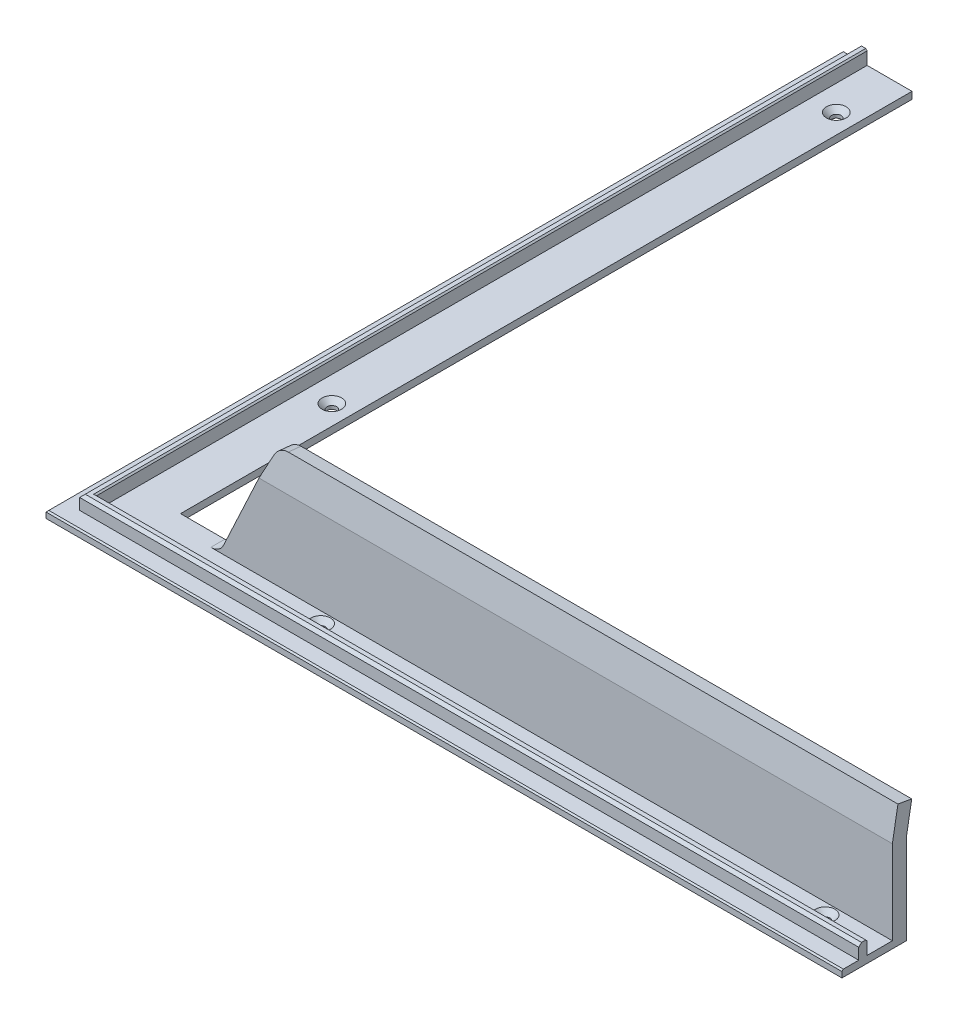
ISO-10303-21;
HEADER;
FILE_DESCRIPTION(('STEP AP214'),'2;1');
FILE_NAME('part.step','',(''),(''),'','','');
FILE_SCHEMA(('AUTOMOTIVE_DESIGN { 1 0 10303 214 1 1 1 1 }'));
ENDSEC;
DATA;
#1=APPLICATION_CONTEXT('core data for automotive mechanical design processes');
#2=APPLICATION_PROTOCOL_DEFINITION('international standard','automotive_design',2000,#1);
#3=PRODUCT_CONTEXT('',#1,'mechanical');
#4=PRODUCT('Part','Part','',(#3));
#5=PRODUCT_RELATED_PRODUCT_CATEGORY('part','',(#4));
#6=PRODUCT_DEFINITION_FORMATION('','',#4);
#7=PRODUCT_DEFINITION_CONTEXT('part definition',#1,'design');
#8=PRODUCT_DEFINITION('design','',#6,#7);
#9=PRODUCT_DEFINITION_SHAPE('','',#8);
#10=(LENGTH_UNIT() NAMED_UNIT(*) SI_UNIT(.MILLI.,.METRE.));
#11=(NAMED_UNIT(*) PLANE_ANGLE_UNIT() SI_UNIT($,.RADIAN.));
#12=(NAMED_UNIT(*) SI_UNIT($,.STERADIAN.) SOLID_ANGLE_UNIT());
#13=UNCERTAINTY_MEASURE_WITH_UNIT(LENGTH_MEASURE(1.E-05),#10,'distance_accuracy_value','');
#14=(GEOMETRIC_REPRESENTATION_CONTEXT(3) GLOBAL_UNCERTAINTY_ASSIGNED_CONTEXT((#13)) GLOBAL_UNIT_ASSIGNED_CONTEXT((#10,
#11,#12)) REPRESENTATION_CONTEXT('',''));
#15=CARTESIAN_POINT('',(0.,0.,0.));
#16=DIRECTION('',(0.,0.,1.));
#17=DIRECTION('',(1.,0.,0.));
#18=AXIS2_PLACEMENT_3D('',#15,#16,#17);
#19=CARTESIAN_POINT('',(0.,3.,0.));
#20=DIRECTION('',(0.,-1.,0.));
#21=DIRECTION('',(0.,0.,-1.));
#22=AXIS2_PLACEMENT_3D('',#19,#20,#21);
#23=PLANE('',#22);
#24=CARTESIAN_POINT('',(239.,3.,8.99999999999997));
#25=DIRECTION('',(0.,1.,0.));
#26=DIRECTION('',(0.,0.,1.));
#27=AXIS2_PLACEMENT_3D('',#24,#25,#26);
#28=CIRCLE('',#27,3.5);
#29=CARTESIAN_POINT('',(239.,3.,12.5));
#30=VERTEX_POINT('',#29);
#31=EDGE_CURVE('E240',#30,#30,#28,.T.);
#32=ORIENTED_EDGE('',*,*,#31,.F.);
#33=EDGE_LOOP('',(#32));
#34=FACE_BOUND('',#33,.T.);
#35=CARTESIAN_POINT('',(59.,3.,8.99999999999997));
#36=DIRECTION('',(0.,1.,0.));
#37=DIRECTION('',(0.,0.,1.));
#38=AXIS2_PLACEMENT_3D('',#35,#36,#37);
#39=CIRCLE('',#38,3.5);
#40=CARTESIAN_POINT('',(59.,3.,12.5));
#41=VERTEX_POINT('',#40);
#42=EDGE_CURVE('E257',#41,#41,#39,.T.);
#43=ORIENTED_EDGE('',*,*,#42,.F.);
#44=EDGE_LOOP('',(#43));
#45=FACE_BOUND('',#44,.T.);
#46=CARTESIAN_POINT('',(-7.00000000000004,3.,-61.0000000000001));
#47=DIRECTION('',(0.,1.,0.));
#48=DIRECTION('',(0.,0.,1.));
#49=AXIS2_PLACEMENT_3D('',#46,#47,#48);
#50=CIRCLE('',#49,3.5);
#51=CARTESIAN_POINT('',(-7.00000000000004,3.,-57.5000000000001));
#52=VERTEX_POINT('',#51);
#53=EDGE_CURVE('E266',#52,#52,#50,.T.);
#54=ORIENTED_EDGE('',*,*,#53,.F.);
#55=EDGE_LOOP('',(#54));
#56=FACE_BOUND('',#55,.T.);
#57=CARTESIAN_POINT('',(-7.00000000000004,3.,-241.));
#58=DIRECTION('',(0.,1.,0.));
#59=DIRECTION('',(0.,0.,1.));
#60=AXIS2_PLACEMENT_3D('',#57,#58,#59);
#61=CIRCLE('',#60,3.5);
#62=CARTESIAN_POINT('',(-7.00000000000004,3.,-237.5));
#63=VERTEX_POINT('',#62);
#64=EDGE_CURVE('E275',#63,#63,#61,.T.);
#65=ORIENTED_EDGE('',*,*,#64,.F.);
#66=EDGE_LOOP('',(#65));
#67=FACE_BOUND('',#66,.T.);
#68=DIRECTION('',(1.,0.,0.));
#69=VECTOR('',#68,1.);
#70=CARTESIAN_POINT('',(19.,3.,5.));
#71=LINE('',#70,#69);
#72=CARTESIAN_POINT('',(15.8146486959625,3.,5.));
#73=VERTEX_POINT('',#72);
#74=CARTESIAN_POINT('',(259.,3.,5.));
#75=VERTEX_POINT('',#74);
#76=EDGE_CURVE('E51',#73,#75,#71,.T.);
#77=ORIENTED_EDGE('',*,*,#76,.F.);
#78=DIRECTION('',(0.,0.,-1.));
#79=VECTOR('',#78,1.);
#80=CARTESIAN_POINT('',(15.8146486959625,3.,0.));
#81=LINE('',#80,#79);
#82=CARTESIAN_POINT('',(15.8146486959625,3.,0.));
#83=VERTEX_POINT('',#82);
#84=EDGE_CURVE('E440',#73,#83,#81,.T.);
#85=ORIENTED_EDGE('',*,*,#84,.T.);
#86=DIRECTION('',(-1.,0.,0.));
#87=VECTOR('',#86,1.);
#88=CARTESIAN_POINT('',(259.,3.,0.));
#89=LINE('',#88,#87);
#90=CARTESIAN_POINT('',(0.,3.,0.));
#91=VERTEX_POINT('',#90);
#92=EDGE_CURVE('E315',#83,#91,#89,.T.);
#93=ORIENTED_EDGE('',*,*,#92,.T.);
#94=DIRECTION('',(0.,0.,-1.));
#95=VECTOR('',#94,1.);
#96=CARTESIAN_POINT('',(0.,3.,0.));
#97=LINE('',#96,#95);
#98=CARTESIAN_POINT('',(0.,3.,-261.));
#99=VERTEX_POINT('',#98);
#100=EDGE_CURVE('E317',#91,#99,#97,.T.);
#101=ORIENTED_EDGE('',*,*,#100,.T.);
#102=DIRECTION('',(-1.,0.,0.));
#103=VECTOR('',#102,1.);
#104=CARTESIAN_POINT('',(0.,3.,-261.));
#105=LINE('',#104,#103);
#106=CARTESIAN_POINT('',(-16.,3.,-261.));
#107=VERTEX_POINT('',#106);
#108=EDGE_CURVE('E320',#99,#107,#105,.T.);
#109=ORIENTED_EDGE('',*,*,#108,.T.);
#110=DIRECTION('',(0.,0.,-1.));
#111=VECTOR('',#110,1.);
#112=CARTESIAN_POINT('',(-16.,3.,14.));
#113=LINE('',#112,#111);
#114=CARTESIAN_POINT('',(-16.,3.,14.));
#115=VERTEX_POINT('',#114);
#116=EDGE_CURVE('E289',#115,#107,#113,.T.);
#117=ORIENTED_EDGE('',*,*,#116,.F.);
#118=DIRECTION('',(-1.,0.,0.));
#119=VECTOR('',#118,1.);
#120=CARTESIAN_POINT('',(259.,3.,14.));
#121=LINE('',#120,#119);
#122=CARTESIAN_POINT('',(259.,3.,14.));
#123=VERTEX_POINT('',#122);
#124=EDGE_CURVE('E299',#123,#115,#121,.T.);
#125=ORIENTED_EDGE('',*,*,#124,.F.);
#126=DIRECTION('',(0.,0.,-1.));
#127=VECTOR('',#126,1.);
#128=CARTESIAN_POINT('',(259.,3.,23.));
#129=LINE('',#128,#127);
#130=EDGE_CURVE('E323',#123,#75,#129,.T.);
#131=ORIENTED_EDGE('',*,*,#130,.T.);
#132=EDGE_LOOP('',(#77,#85,#93,#101,#109,#117,#125,#131));
#133=FACE_BOUND('',#132,.T.);
#134=ADVANCED_FACE('F36',(#34,#45,#56,#67,#133),#23,.F.);
#135=CARTESIAN_POINT('',(-19.,3.,-261.));
#136=VERTEX_POINT('',#135);
#137=CARTESIAN_POINT('',(-24.5,3.,-261.));
#138=VERTEX_POINT('',#137);
#139=EDGE_CURVE('E319',#136,#138,#105,.T.);
#140=ORIENTED_EDGE('',*,*,#139,.T.);
#141=DIRECTION('',(0.,0.,1.));
#142=VECTOR('',#141,1.);
#143=CARTESIAN_POINT('',(-24.5,3.,0.));
#144=LINE('',#143,#142);
#145=CARTESIAN_POINT('',(-24.5,3.,22.5));
#146=VERTEX_POINT('',#145);
#147=EDGE_CURVE('E386',#138,#146,#144,.T.);
#148=ORIENTED_EDGE('',*,*,#147,.T.);
#149=DIRECTION('',(1.,0.,0.));
#150=VECTOR('',#149,1.);
#151=CARTESIAN_POINT('',(0.,3.,22.5));
#152=LINE('',#151,#150);
#153=CARTESIAN_POINT('',(259.,3.,22.5));
#154=VERTEX_POINT('',#153);
#155=EDGE_CURVE('E384',#146,#154,#152,.T.);
#156=ORIENTED_EDGE('',*,*,#155,.T.);
#157=CARTESIAN_POINT('',(259.,3.,17.));
#158=VERTEX_POINT('',#157);
#159=EDGE_CURVE('E324',#154,#158,#129,.T.);
#160=ORIENTED_EDGE('',*,*,#159,.T.);
#161=DIRECTION('',(1.,0.,0.));
#162=VECTOR('',#161,1.);
#163=CARTESIAN_POINT('',(-19.,3.,17.));
#164=LINE('',#163,#162);
#165=CARTESIAN_POINT('',(-19.,3.,17.));
#166=VERTEX_POINT('',#165);
#167=EDGE_CURVE('E295',#166,#158,#164,.T.);
#168=ORIENTED_EDGE('',*,*,#167,.F.);
#169=DIRECTION('',(0.,0.,1.));
#170=VECTOR('',#169,1.);
#171=CARTESIAN_POINT('',(-19.,3.,-261.));
#172=LINE('',#171,#170);
#173=EDGE_CURVE('E292',#136,#166,#172,.T.);
#174=ORIENTED_EDGE('',*,*,#173,.F.);
#175=EDGE_LOOP('',(#140,#148,#156,#160,#168,#174));
#176=FACE_BOUND('',#175,.T.);
#177=ADVANCED_FACE('F482',(#176),#23,.F.);
#178=CARTESIAN_POINT('',(259.,3.,0.));
#179=DIRECTION('',(0.,0.,1.));
#180=DIRECTION('',(1.,0.,0.));
#181=AXIS2_PLACEMENT_3D('',#178,#179,#180);
#182=PLANE('',#181);
#183=ORIENTED_EDGE('',*,*,#92,.F.);
#184=CARTESIAN_POINT('',(15.8146486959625,8.,0.));
#185=DIRECTION('',(0.,0.,1.));
#186=DIRECTION('',(1.,0.,0.));
#187=AXIS2_PLACEMENT_3D('',#184,#185,#186);
#188=CIRCLE('',#187,5.);
#189=CARTESIAN_POINT('',(20.3461876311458,5.88690869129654,0.));
#190=VERTEX_POINT('',#189);
#191=EDGE_CURVE('E44',#83,#190,#188,.T.);
#192=ORIENTED_EDGE('',*,*,#191,.T.);
#193=DIRECTION('',(0.422618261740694,0.906307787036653,0.));
#194=VECTOR('',#193,1.);
#195=CARTESIAN_POINT('',(61.8654868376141,94.9253331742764,0.));
#196=LINE('',#195,#194);
#197=CARTESIAN_POINT('',(32.7852465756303,32.5625566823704,0.));
#198=VERTEX_POINT('',#197);
#199=EDGE_CURVE('E232',#190,#198,#196,.T.);
#200=ORIENTED_EDGE('',*,*,#199,.T.);
#201=DIRECTION('',(1.,0.,0.));
#202=VECTOR('',#201,1.);
#203=CARTESIAN_POINT('',(19.,32.5625566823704,0.));
#204=LINE('',#203,#202);
#205=CARTESIAN_POINT('',(259.,32.5625566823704,0.));
#206=VERTEX_POINT('',#205);
#207=EDGE_CURVE('E247',#198,#206,#204,.T.);
#208=ORIENTED_EDGE('',*,*,#207,.T.);
#209=DIRECTION('',(0.,-1.,0.));
#210=VECTOR('',#209,1.);
#211=CARTESIAN_POINT('',(259.,3.,0.));
#212=LINE('',#211,#210);
#213=CARTESIAN_POINT('',(259.,0.500000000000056,0.));
#214=VERTEX_POINT('',#213);
#215=EDGE_CURVE('E327',#206,#214,#212,.T.);
#216=ORIENTED_EDGE('',*,*,#215,.T.);
#217=DIRECTION('',(-1.,0.,0.));
#218=VECTOR('',#217,1.);
#219=CARTESIAN_POINT('',(0.,0.500000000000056,0.));
#220=LINE('',#219,#218);
#221=CARTESIAN_POINT('',(0.,0.500000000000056,0.));
#222=VERTEX_POINT('',#221);
#223=EDGE_CURVE('E382',#214,#222,#220,.T.);
#224=ORIENTED_EDGE('',*,*,#223,.T.);
#225=DIRECTION('',(0.,-1.,0.));
#226=VECTOR('',#225,1.);
#227=CARTESIAN_POINT('',(0.,3.,0.));
#228=LINE('',#227,#226);
#229=EDGE_CURVE('E342',#91,#222,#228,.T.);
#230=ORIENTED_EDGE('',*,*,#229,.F.);
#231=EDGE_LOOP('',(#183,#192,#200,#208,#216,#224,#230));
#232=FACE_BOUND('',#231,.T.);
#233=ADVANCED_FACE('F443',(#232),#182,.F.);
#234=CARTESIAN_POINT('',(0.,3.,0.));
#235=DIRECTION('',(-1.,0.,0.));
#236=DIRECTION('',(0.,0.,1.));
#237=AXIS2_PLACEMENT_3D('',#234,#235,#236);
#238=PLANE('',#237);
#239=ORIENTED_EDGE('',*,*,#229,.T.);
#240=DIRECTION('',(0.,0.,-1.));
#241=VECTOR('',#240,1.);
#242=CARTESIAN_POINT('',(0.,0.500000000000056,-261.));
#243=LINE('',#242,#241);
#244=CARTESIAN_POINT('',(0.,0.500000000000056,-261.));
#245=VERTEX_POINT('',#244);
#246=EDGE_CURVE('E345',#222,#245,#243,.T.);
#247=ORIENTED_EDGE('',*,*,#246,.T.);
#248=DIRECTION('',(0.,-1.,0.));
#249=VECTOR('',#248,1.);
#250=CARTESIAN_POINT('',(0.,3.,-261.));
#251=LINE('',#250,#249);
#252=EDGE_CURVE('E339',#99,#245,#251,.T.);
#253=ORIENTED_EDGE('',*,*,#252,.F.);
#254=ORIENTED_EDGE('',*,*,#100,.F.);
#255=EDGE_LOOP('',(#239,#247,#253,#254));
#256=FACE_BOUND('',#255,.T.);
#257=ADVANCED_FACE('F512',(#256),#238,.F.);
#258=CARTESIAN_POINT('',(0.,3.,-261.));
#259=DIRECTION('',(0.,0.,1.));
#260=DIRECTION('',(1.,0.,0.));
#261=AXIS2_PLACEMENT_3D('',#258,#259,#260);
#262=PLANE('',#261);
#263=DIRECTION('',(0.,-1.,0.));
#264=VECTOR('',#263,1.);
#265=CARTESIAN_POINT('',(-19.,8.,-261.));
#266=LINE('',#265,#264);
#267=CARTESIAN_POINT('',(-19.,7.,-261.));
#268=VERTEX_POINT('',#267);
#269=EDGE_CURVE('E313',#268,#136,#266,.T.);
#270=ORIENTED_EDGE('',*,*,#269,.F.);
#271=DIRECTION('',(0.707106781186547,0.707106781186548,0.));
#272=VECTOR('',#271,1.);
#273=CARTESIAN_POINT('',(-18.,8.00000000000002,-261.));
#274=LINE('',#273,#272);
#275=CARTESIAN_POINT('',(-18.,8.,-261.));
#276=VERTEX_POINT('',#275);
#277=EDGE_CURVE('E425',#268,#276,#274,.T.);
#278=ORIENTED_EDGE('',*,*,#277,.T.);
#279=DIRECTION('',(-1.,0.,0.));
#280=VECTOR('',#279,1.);
#281=CARTESIAN_POINT('',(-16.,8.,-261.));
#282=LINE('',#281,#280);
#283=CARTESIAN_POINT('',(-16.5000000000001,8.,-261.));
#284=VERTEX_POINT('',#283);
#285=EDGE_CURVE('E285',#284,#276,#282,.T.);
#286=ORIENTED_EDGE('',*,*,#285,.F.);
#287=DIRECTION('',(0.707106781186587,-0.707106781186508,0.));
#288=VECTOR('',#287,1.);
#289=CARTESIAN_POINT('',(-16.5000000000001,8.00000000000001,-261.));
#290=LINE('',#289,#288);
#291=CARTESIAN_POINT('',(-16.,7.49999999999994,-261.));
#292=VERTEX_POINT('',#291);
#293=EDGE_CURVE('E361',#284,#292,#290,.T.);
#294=ORIENTED_EDGE('',*,*,#293,.T.);
#295=DIRECTION('',(0.,-1.,0.));
#296=VECTOR('',#295,1.);
#297=CARTESIAN_POINT('',(-16.,8.,-261.));
#298=LINE('',#297,#296);
#299=EDGE_CURVE('E291',#292,#107,#298,.T.);
#300=ORIENTED_EDGE('',*,*,#299,.T.);
#301=ORIENTED_EDGE('',*,*,#108,.F.);
#302=ORIENTED_EDGE('',*,*,#252,.T.);
#303=DIRECTION('',(-1.,0.,0.));
#304=VECTOR('',#303,1.);
#305=CARTESIAN_POINT('',(-25.,0.500000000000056,-261.));
#306=LINE('',#305,#304);
#307=CARTESIAN_POINT('',(-25.,0.500000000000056,-261.));
#308=VERTEX_POINT('',#307);
#309=EDGE_CURVE('E365',#245,#308,#306,.T.);
#310=ORIENTED_EDGE('',*,*,#309,.T.);
#311=DIRECTION('',(0.,-1.,0.));
#312=VECTOR('',#311,1.);
#313=CARTESIAN_POINT('',(-25.,3.,-261.));
#314=LINE('',#313,#312);
#315=CARTESIAN_POINT('',(-25.,2.5,-261.));
#316=VERTEX_POINT('',#315);
#317=EDGE_CURVE('E336',#316,#308,#314,.T.);
#318=ORIENTED_EDGE('',*,*,#317,.F.);
#319=DIRECTION('',(-0.707106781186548,-0.707106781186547,0.));
#320=VECTOR('',#319,1.);
#321=CARTESIAN_POINT('',(-24.5,2.99999999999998,-261.));
#322=LINE('',#321,#320);
#323=EDGE_CURVE('E363',#316,#138,#322,.F.);
#324=ORIENTED_EDGE('',*,*,#323,.T.);
#325=ORIENTED_EDGE('',*,*,#139,.F.);
#326=EDGE_LOOP('',(#270,#278,#286,#294,#300,#301,#302,#310,#318,#324,#325));
#327=FACE_BOUND('',#326,.T.);
#328=ADVANCED_FACE('F508',(#327),#262,.F.);
#329=CARTESIAN_POINT('',(-25.,3.,-261.));
#330=DIRECTION('',(1.,0.,0.));
#331=DIRECTION('',(0.,0.,-1.));
#332=AXIS2_PLACEMENT_3D('',#329,#330,#331);
#333=PLANE('',#332);
#334=ORIENTED_EDGE('',*,*,#317,.T.);
#335=DIRECTION('',(0.,0.,1.));
#336=VECTOR('',#335,1.);
#337=CARTESIAN_POINT('',(-25.,0.500000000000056,23.));
#338=LINE('',#337,#336);
#339=CARTESIAN_POINT('',(-25.,0.500000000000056,23.));
#340=VERTEX_POINT('',#339);
#341=EDGE_CURVE('E369',#308,#340,#338,.T.);
#342=ORIENTED_EDGE('',*,*,#341,.T.);
#343=DIRECTION('',(0.,-1.,0.));
#344=VECTOR('',#343,1.);
#345=CARTESIAN_POINT('',(-25.,3.,23.));
#346=LINE('',#345,#344);
#347=CARTESIAN_POINT('',(-25.,2.5,23.));
#348=VERTEX_POINT('',#347);
#349=EDGE_CURVE('E333',#348,#340,#346,.T.);
#350=ORIENTED_EDGE('',*,*,#349,.F.);
#351=DIRECTION('',(0.,0.,-1.));
#352=VECTOR('',#351,1.);
#353=CARTESIAN_POINT('',(-25.,2.5,-261.));
#354=LINE('',#353,#352);
#355=EDGE_CURVE('E367',#348,#316,#354,.T.);
#356=ORIENTED_EDGE('',*,*,#355,.T.);
#357=EDGE_LOOP('',(#334,#342,#350,#356));
#358=FACE_BOUND('',#357,.T.);
#359=ADVANCED_FACE('F504',(#358),#333,.F.);
#360=CARTESIAN_POINT('',(-25.,3.,23.));
#361=DIRECTION('',(0.,0.,-1.));
#362=DIRECTION('',(-1.,0.,0.));
#363=AXIS2_PLACEMENT_3D('',#360,#361,#362);
#364=PLANE('',#363);
#365=ORIENTED_EDGE('',*,*,#349,.T.);
#366=DIRECTION('',(1.,0.,0.));
#367=VECTOR('',#366,1.);
#368=CARTESIAN_POINT('',(259.,0.500000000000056,23.));
#369=LINE('',#368,#367);
#370=CARTESIAN_POINT('',(259.,0.500000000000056,23.));
#371=VERTEX_POINT('',#370);
#372=EDGE_CURVE('E373',#340,#371,#369,.T.);
#373=ORIENTED_EDGE('',*,*,#372,.T.);
#374=DIRECTION('',(0.,-1.,0.));
#375=VECTOR('',#374,1.);
#376=CARTESIAN_POINT('',(259.,3.,23.));
#377=LINE('',#376,#375);
#378=CARTESIAN_POINT('',(259.,2.5,23.));
#379=VERTEX_POINT('',#378);
#380=EDGE_CURVE('E330',#379,#371,#377,.T.);
#381=ORIENTED_EDGE('',*,*,#380,.F.);
#382=DIRECTION('',(-1.,0.,0.));
#383=VECTOR('',#382,1.);
#384=CARTESIAN_POINT('',(-25.,2.5,23.));
#385=LINE('',#384,#383);
#386=EDGE_CURVE('E371',#379,#348,#385,.T.);
#387=ORIENTED_EDGE('',*,*,#386,.T.);
#388=EDGE_LOOP('',(#365,#373,#381,#387));
#389=FACE_BOUND('',#388,.T.);
#390=ADVANCED_FACE('F501',(#389),#364,.F.);
#391=CARTESIAN_POINT('',(259.,3.,23.));
#392=DIRECTION('',(-1.,0.,0.));
#393=DIRECTION('',(0.,0.,1.));
#394=AXIS2_PLACEMENT_3D('',#391,#392,#393);
#395=PLANE('',#394);
#396=DIRECTION('',(0.,0.,-1.));
#397=VECTOR('',#396,1.);
#398=CARTESIAN_POINT('',(259.,8.,17.));
#399=LINE('',#398,#397);
#400=CARTESIAN_POINT('',(259.,8.,16.));
#401=VERTEX_POINT('',#400);
#402=CARTESIAN_POINT('',(259.,8.,14.5000000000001));
#403=VERTEX_POINT('',#402);
#404=EDGE_CURVE('E288',#401,#403,#399,.T.);
#405=ORIENTED_EDGE('',*,*,#404,.F.);
#406=DIRECTION('',(0.,-0.707106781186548,0.707106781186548));
#407=VECTOR('',#406,1.);
#408=CARTESIAN_POINT('',(259.,8.,16.));
#409=LINE('',#408,#407);
#410=CARTESIAN_POINT('',(259.,7.,17.));
#411=VERTEX_POINT('',#410);
#412=EDGE_CURVE('E427',#401,#411,#409,.T.);
#413=ORIENTED_EDGE('',*,*,#412,.T.);
#414=DIRECTION('',(0.,-1.,0.));
#415=VECTOR('',#414,1.);
#416=CARTESIAN_POINT('',(259.,8.,17.));
#417=LINE('',#416,#415);
#418=EDGE_CURVE('E309',#411,#158,#417,.T.);
#419=ORIENTED_EDGE('',*,*,#418,.T.);
#420=ORIENTED_EDGE('',*,*,#159,.F.);
#421=DIRECTION('',(0.,0.707106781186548,-0.707106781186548));
#422=VECTOR('',#421,1.);
#423=CARTESIAN_POINT('',(259.,3.,22.5));
#424=LINE('',#423,#422);
#425=EDGE_CURVE('E378',#154,#379,#424,.F.);
#426=ORIENTED_EDGE('',*,*,#425,.T.);
#427=ORIENTED_EDGE('',*,*,#380,.T.);
#428=DIRECTION('',(0.,0.,-1.));
#429=VECTOR('',#428,1.);
#430=CARTESIAN_POINT('',(259.,0.500000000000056,0.));
#431=LINE('',#430,#429);
#432=EDGE_CURVE('E380',#371,#214,#431,.T.);
#433=ORIENTED_EDGE('',*,*,#432,.T.);
#434=ORIENTED_EDGE('',*,*,#215,.F.);
#435=DIRECTION('',(0.,0.984807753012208,-0.173648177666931));
#436=VECTOR('',#435,1.);
#437=CARTESIAN_POINT('',(259.,32.5625566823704,0.));
#438=LINE('',#437,#436);
#439=CARTESIAN_POINT('',(259.,43.3954419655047,-1.91012995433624));
#440=VERTEX_POINT('',#439);
#441=EDGE_CURVE('E448',#206,#440,#438,.T.);
#442=ORIENTED_EDGE('',*,*,#441,.T.);
#443=DIRECTION('',(0.,0.173648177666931,0.984807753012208));
#444=VECTOR('',#443,1.);
#445=CARTESIAN_POINT('',(259.,43.3954419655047,-1.91012995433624));
#446=LINE('',#445,#444);
#447=CARTESIAN_POINT('',(259.,44.2636828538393,3.0139088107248));
#448=VERTEX_POINT('',#447);
#449=EDGE_CURVE('E457',#440,#448,#446,.T.);
#450=ORIENTED_EDGE('',*,*,#449,.T.);
#451=DIRECTION('',(0.,-0.984807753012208,0.173648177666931));
#452=VECTOR('',#451,1.);
#453=CARTESIAN_POINT('',(259.,44.2636828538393,3.0139088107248));
#454=LINE('',#453,#452);
#455=CARTESIAN_POINT('',(259.,33.,5.));
#456=VERTEX_POINT('',#455);
#457=EDGE_CURVE('E456',#448,#456,#454,.T.);
#458=ORIENTED_EDGE('',*,*,#457,.T.);
#459=DIRECTION('',(0.,-1.,0.));
#460=VECTOR('',#459,1.);
#461=CARTESIAN_POINT('',(259.,33.,5.));
#462=LINE('',#461,#460);
#463=EDGE_CURVE('E237',#456,#75,#462,.T.);
#464=ORIENTED_EDGE('',*,*,#463,.T.);
#465=ORIENTED_EDGE('',*,*,#130,.F.);
#466=DIRECTION('',(0.,-1.,0.));
#467=VECTOR('',#466,1.);
#468=CARTESIAN_POINT('',(259.,8.,14.));
#469=LINE('',#468,#467);
#470=CARTESIAN_POINT('',(259.,7.49999999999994,14.));
#471=VERTEX_POINT('',#470);
#472=EDGE_CURVE('E307',#471,#123,#469,.T.);
#473=ORIENTED_EDGE('',*,*,#472,.F.);
#474=DIRECTION('',(0.,0.707106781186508,0.707106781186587));
#475=VECTOR('',#474,1.);
#476=CARTESIAN_POINT('',(259.,8.00000000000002,14.5000000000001));
#477=LINE('',#476,#475);
#478=EDGE_CURVE('E375',#471,#403,#477,.T.);
#479=ORIENTED_EDGE('',*,*,#478,.T.);
#480=EDGE_LOOP('',(#405,#413,#419,#420,#426,#427,#433,#434,#442,#450,#458,#464,#465,#473,#479));
#481=FACE_BOUND('',#480,.T.);
#482=ADVANCED_FACE('F453',(#481),#395,.F.);
#483=CARTESIAN_POINT('',(0.,0.,0.));
#484=DIRECTION('',(0.,-1.,0.));
#485=DIRECTION('',(0.,0.,-1.));
#486=AXIS2_PLACEMENT_3D('',#483,#484,#485);
#487=PLANE('',#486);
#488=CARTESIAN_POINT('',(239.,0.,8.99999999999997));
#489=DIRECTION('',(0.,1.,0.));
#490=DIRECTION('',(0.,0.,1.));
#491=AXIS2_PLACEMENT_3D('',#488,#489,#490);
#492=CIRCLE('',#491,1.70000000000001);
#493=CARTESIAN_POINT('',(239.,0.,10.7));
#494=VERTEX_POINT('',#493);
#495=EDGE_CURVE('E254',#494,#494,#492,.T.);
#496=ORIENTED_EDGE('',*,*,#495,.T.);
#497=EDGE_LOOP('',(#496));
#498=FACE_BOUND('',#497,.T.);
#499=CARTESIAN_POINT('',(59.,0.,8.99999999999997));
#500=DIRECTION('',(0.,1.,0.));
#501=DIRECTION('',(0.,0.,1.));
#502=AXIS2_PLACEMENT_3D('',#499,#500,#501);
#503=CIRCLE('',#502,1.7);
#504=CARTESIAN_POINT('',(59.,0.,10.7));
#505=VERTEX_POINT('',#504);
#506=EDGE_CURVE('E263',#505,#505,#503,.T.);
#507=ORIENTED_EDGE('',*,*,#506,.T.);
#508=EDGE_LOOP('',(#507));
#509=FACE_BOUND('',#508,.T.);
#510=CARTESIAN_POINT('',(-7.00000000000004,0.,-61.0000000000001));
#511=DIRECTION('',(0.,1.,0.));
#512=DIRECTION('',(0.,0.,1.));
#513=AXIS2_PLACEMENT_3D('',#510,#511,#512);
#514=CIRCLE('',#513,1.7);
#515=CARTESIAN_POINT('',(-7.00000000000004,0.,-59.3000000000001));
#516=VERTEX_POINT('',#515);
#517=EDGE_CURVE('E272',#516,#516,#514,.T.);
#518=ORIENTED_EDGE('',*,*,#517,.T.);
#519=EDGE_LOOP('',(#518));
#520=FACE_BOUND('',#519,.T.);
#521=CARTESIAN_POINT('',(-7.00000000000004,0.,-241.));
#522=DIRECTION('',(0.,1.,0.));
#523=DIRECTION('',(0.,0.,1.));
#524=AXIS2_PLACEMENT_3D('',#521,#522,#523);
#525=CIRCLE('',#524,1.7);
#526=CARTESIAN_POINT('',(-7.00000000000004,0.,-239.3));
#527=VERTEX_POINT('',#526);
#528=EDGE_CURVE('E281',#527,#527,#525,.T.);
#529=ORIENTED_EDGE('',*,*,#528,.T.);
#530=EDGE_LOOP('',(#529));
#531=FACE_BOUND('',#530,.T.);
#532=DIRECTION('',(1.,0.,0.));
#533=VECTOR('',#532,1.);
#534=CARTESIAN_POINT('',(0.,0.,-260.5));
#535=LINE('',#534,#533);
#536=CARTESIAN_POINT('',(-24.5,0.,-260.5));
#537=VERTEX_POINT('',#536);
#538=CARTESIAN_POINT('',(-0.5,0.,-260.5));
#539=VERTEX_POINT('',#538);
#540=EDGE_CURVE('E356',#537,#539,#535,.T.);
#541=ORIENTED_EDGE('',*,*,#540,.T.);
#542=DIRECTION('',(0.,0.,1.));
#543=VECTOR('',#542,1.);
#544=CARTESIAN_POINT('',(-0.5,0.,0.));
#545=LINE('',#544,#543);
#546=CARTESIAN_POINT('',(-0.5,0.,0.500000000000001));
#547=VERTEX_POINT('',#546);
#548=EDGE_CURVE('E358',#539,#547,#545,.T.);
#549=ORIENTED_EDGE('',*,*,#548,.T.);
#550=DIRECTION('',(1.,0.,0.));
#551=VECTOR('',#550,1.);
#552=CARTESIAN_POINT('',(259.,0.,0.499999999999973));
#553=LINE('',#552,#551);
#554=CARTESIAN_POINT('',(258.5,0.,0.499999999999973));
#555=VERTEX_POINT('',#554);
#556=EDGE_CURVE('E348',#547,#555,#553,.T.);
#557=ORIENTED_EDGE('',*,*,#556,.T.);
#558=DIRECTION('',(0.,0.,1.));
#559=VECTOR('',#558,1.);
#560=CARTESIAN_POINT('',(258.5,0.,23.));
#561=LINE('',#560,#559);
#562=CARTESIAN_POINT('',(258.5,0.,22.5));
#563=VERTEX_POINT('',#562);
#564=EDGE_CURVE('E350',#555,#563,#561,.T.);
#565=ORIENTED_EDGE('',*,*,#564,.T.);
#566=DIRECTION('',(-1.,0.,0.));
#567=VECTOR('',#566,1.);
#568=CARTESIAN_POINT('',(-25.,0.,22.5));
#569=LINE('',#568,#567);
#570=CARTESIAN_POINT('',(-24.5,0.,22.5));
#571=VERTEX_POINT('',#570);
#572=EDGE_CURVE('E352',#563,#571,#569,.T.);
#573=ORIENTED_EDGE('',*,*,#572,.T.);
#574=DIRECTION('',(0.,0.,-1.));
#575=VECTOR('',#574,1.);
#576=CARTESIAN_POINT('',(-24.5,0.,-261.));
#577=LINE('',#576,#575);
#578=EDGE_CURVE('E354',#571,#537,#577,.T.);
#579=ORIENTED_EDGE('',*,*,#578,.T.);
#580=EDGE_LOOP('',(#541,#549,#557,#565,#573,#579));
#581=FACE_BOUND('',#580,.T.);
#582=ADVANCED_FACE('F495',(#498,#509,#520,#531,#581),#487,.T.);
#583=CARTESIAN_POINT('',(-19.,8.,-261.));
#584=DIRECTION('',(1.,0.,0.));
#585=DIRECTION('',(0.,0.,-1.));
#586=AXIS2_PLACEMENT_3D('',#583,#584,#585);
#587=PLANE('',#586);
#588=DIRECTION('',(0.,-1.,0.));
#589=VECTOR('',#588,1.);
#590=CARTESIAN_POINT('',(-19.,8.,17.));
#591=LINE('',#590,#589);
#592=CARTESIAN_POINT('',(-19.,7.,17.));
#593=VERTEX_POINT('',#592);
#594=EDGE_CURVE('E311',#593,#166,#591,.T.);
#595=ORIENTED_EDGE('',*,*,#594,.F.);
#596=DIRECTION('',(0.,0.,-1.));
#597=VECTOR('',#596,1.);
#598=CARTESIAN_POINT('',(-19.,7.,-261.));
#599=LINE('',#598,#597);
#600=EDGE_CURVE('E423',#593,#268,#599,.T.);
#601=ORIENTED_EDGE('',*,*,#600,.T.);
#602=ORIENTED_EDGE('',*,*,#269,.T.);
#603=ORIENTED_EDGE('',*,*,#173,.T.);
#604=EDGE_LOOP('',(#595,#601,#602,#603));
#605=FACE_BOUND('',#604,.T.);
#606=ADVANCED_FACE('F493',(#605),#587,.F.);
#607=CARTESIAN_POINT('',(-19.,8.,17.));
#608=DIRECTION('',(0.,0.,-1.));
#609=DIRECTION('',(-1.,0.,0.));
#610=AXIS2_PLACEMENT_3D('',#607,#608,#609);
#611=PLANE('',#610);
#612=ORIENTED_EDGE('',*,*,#418,.F.);
#613=DIRECTION('',(-1.,0.,0.));
#614=VECTOR('',#613,1.);
#615=CARTESIAN_POINT('',(-19.,7.,17.));
#616=LINE('',#615,#614);
#617=EDGE_CURVE('E429',#411,#593,#616,.T.);
#618=ORIENTED_EDGE('',*,*,#617,.T.);
#619=ORIENTED_EDGE('',*,*,#594,.T.);
#620=ORIENTED_EDGE('',*,*,#167,.T.);
#621=EDGE_LOOP('',(#612,#618,#619,#620));
#622=FACE_BOUND('',#621,.T.);
#623=ADVANCED_FACE('F612',(#622),#611,.F.);
#624=CARTESIAN_POINT('',(259.,8.,14.));
#625=DIRECTION('',(0.,0.,1.));
#626=DIRECTION('',(1.,0.,0.));
#627=AXIS2_PLACEMENT_3D('',#624,#625,#626);
#628=PLANE('',#627);
#629=DIRECTION('',(0.,-1.,0.));
#630=VECTOR('',#629,1.);
#631=CARTESIAN_POINT('',(-16.,8.,14.));
#632=LINE('',#631,#630);
#633=CARTESIAN_POINT('',(-16.,7.49999999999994,14.));
#634=VERTEX_POINT('',#633);
#635=EDGE_CURVE('E305',#634,#115,#632,.T.);
#636=ORIENTED_EDGE('',*,*,#635,.F.);
#637=DIRECTION('',(1.,0.,0.));
#638=VECTOR('',#637,1.);
#639=CARTESIAN_POINT('',(259.,7.49999999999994,14.));
#640=LINE('',#639,#638);
#641=EDGE_CURVE('E396',#634,#471,#640,.T.);
#642=ORIENTED_EDGE('',*,*,#641,.T.);
#643=ORIENTED_EDGE('',*,*,#472,.T.);
#644=ORIENTED_EDGE('',*,*,#124,.T.);
#645=EDGE_LOOP('',(#636,#642,#643,#644));
#646=FACE_BOUND('',#645,.T.);
#647=ADVANCED_FACE('F638',(#646),#628,.F.);
#648=CARTESIAN_POINT('',(-16.,8.,14.));
#649=DIRECTION('',(-1.,0.,0.));
#650=DIRECTION('',(0.,0.,1.));
#651=AXIS2_PLACEMENT_3D('',#648,#649,#650);
#652=PLANE('',#651);
#653=ORIENTED_EDGE('',*,*,#299,.F.);
#654=DIRECTION('',(0.,0.,1.));
#655=VECTOR('',#654,1.);
#656=CARTESIAN_POINT('',(-16.,7.49999999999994,14.));
#657=LINE('',#656,#655);
#658=EDGE_CURVE('E394',#292,#634,#657,.T.);
#659=ORIENTED_EDGE('',*,*,#658,.T.);
#660=ORIENTED_EDGE('',*,*,#635,.T.);
#661=ORIENTED_EDGE('',*,*,#116,.T.);
#662=EDGE_LOOP('',(#653,#659,#660,#661));
#663=FACE_BOUND('',#662,.T.);
#664=ADVANCED_FACE('F630',(#663),#652,.F.);
#665=CARTESIAN_POINT('',(0.,8.,0.));
#666=DIRECTION('',(0.,1.,0.));
#667=DIRECTION('',(0.,0.,1.));
#668=AXIS2_PLACEMENT_3D('',#665,#666,#667);
#669=PLANE('',#668);
#670=ORIENTED_EDGE('',*,*,#285,.T.);
#671=DIRECTION('',(0.,0.,1.));
#672=VECTOR('',#671,1.);
#673=CARTESIAN_POINT('',(-18.,8.,17.));
#674=LINE('',#673,#672);
#675=CARTESIAN_POINT('',(-18.,8.,16.));
#676=VERTEX_POINT('',#675);
#677=EDGE_CURVE('E420',#276,#676,#674,.T.);
#678=ORIENTED_EDGE('',*,*,#677,.T.);
#679=DIRECTION('',(1.,0.,0.));
#680=VECTOR('',#679,1.);
#681=CARTESIAN_POINT('',(259.,8.,16.));
#682=LINE('',#681,#680);
#683=EDGE_CURVE('E398',#676,#401,#682,.T.);
#684=ORIENTED_EDGE('',*,*,#683,.T.);
#685=ORIENTED_EDGE('',*,*,#404,.T.);
#686=DIRECTION('',(-1.,0.,0.));
#687=VECTOR('',#686,1.);
#688=CARTESIAN_POINT('',(-16.,8.,14.5000000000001));
#689=LINE('',#688,#687);
#690=CARTESIAN_POINT('',(-16.5000000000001,8.,14.5000000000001));
#691=VERTEX_POINT('',#690);
#692=EDGE_CURVE('E389',#403,#691,#689,.T.);
#693=ORIENTED_EDGE('',*,*,#692,.T.);
#694=DIRECTION('',(0.,0.,-1.));
#695=VECTOR('',#694,1.);
#696=CARTESIAN_POINT('',(-16.5000000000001,8.,-261.));
#697=LINE('',#696,#695);
#698=EDGE_CURVE('E391',#691,#284,#697,.T.);
#699=ORIENTED_EDGE('',*,*,#698,.T.);
#700=EDGE_LOOP('',(#670,#678,#684,#685,#693,#699));
#701=FACE_BOUND('',#700,.T.);
#702=ADVANCED_FACE('F562',(#701),#669,.T.);
#703=CARTESIAN_POINT('',(-25.,0.500000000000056,23.));
#704=DIRECTION('',(0.,-0.707106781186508,0.707106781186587));
#705=DIRECTION('',(-1.,0.,0.));
#706=AXIS2_PLACEMENT_3D('',#703,#704,#705);
#707=PLANE('',#706);
#708=DIRECTION('',(0.577350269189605,-0.577350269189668,-0.577350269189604));
#709=VECTOR('',#708,1.);
#710=CARTESIAN_POINT('',(-25.,0.500000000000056,23.));
#711=LINE('',#710,#709);
#712=EDGE_CURVE('E410',#571,#340,#711,.F.);
#713=ORIENTED_EDGE('',*,*,#712,.F.);
#714=ORIENTED_EDGE('',*,*,#572,.F.);
#715=DIRECTION('',(-0.577350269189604,-0.577350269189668,-0.577350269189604));
#716=VECTOR('',#715,1.);
#717=CARTESIAN_POINT('',(259.,0.500000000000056,23.));
#718=LINE('',#717,#716);
#719=EDGE_CURVE('E296',#371,#563,#718,.T.);
#720=ORIENTED_EDGE('',*,*,#719,.F.);
#721=ORIENTED_EDGE('',*,*,#372,.F.);
#722=EDGE_LOOP('',(#713,#714,#720,#721));
#723=FACE_BOUND('',#722,.T.);
#724=ADVANCED_FACE('F556',(#723),#707,.T.);
#725=CARTESIAN_POINT('',(259.,0.500000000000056,23.));
#726=DIRECTION('',(0.707106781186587,-0.707106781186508,0.));
#727=DIRECTION('',(0.,0.,1.));
#728=AXIS2_PLACEMENT_3D('',#725,#726,#727);
#729=PLANE('',#728);
#730=ORIENTED_EDGE('',*,*,#719,.T.);
#731=ORIENTED_EDGE('',*,*,#564,.F.);
#732=DIRECTION('',(-0.577350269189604,-0.577350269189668,0.577350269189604));
#733=VECTOR('',#732,1.);
#734=CARTESIAN_POINT('',(259.,0.500000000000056,0.));
#735=LINE('',#734,#733);
#736=EDGE_CURVE('E407',#214,#555,#735,.T.);
#737=ORIENTED_EDGE('',*,*,#736,.F.);
#738=ORIENTED_EDGE('',*,*,#432,.F.);
#739=EDGE_LOOP('',(#730,#731,#737,#738));
#740=FACE_BOUND('',#739,.T.);
#741=ADVANCED_FACE('F549',(#740),#729,.T.);
#742=CARTESIAN_POINT('',(-25.,0.500000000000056,-261.));
#743=DIRECTION('',(-0.707106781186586,-0.707106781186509,0.));
#744=DIRECTION('',(0.,0.,-1.));
#745=AXIS2_PLACEMENT_3D('',#742,#743,#744);
#746=PLANE('',#745);
#747=ORIENTED_EDGE('',*,*,#712,.T.);
#748=ORIENTED_EDGE('',*,*,#341,.F.);
#749=DIRECTION('',(0.577350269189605,-0.577350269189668,0.577350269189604));
#750=VECTOR('',#749,1.);
#751=CARTESIAN_POINT('',(-25.,0.500000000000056,-261.));
#752=LINE('',#751,#750);
#753=EDGE_CURVE('E404',#537,#308,#752,.F.);
#754=ORIENTED_EDGE('',*,*,#753,.F.);
#755=ORIENTED_EDGE('',*,*,#578,.F.);
#756=EDGE_LOOP('',(#747,#748,#754,#755));
#757=FACE_BOUND('',#756,.T.);
#758=ADVANCED_FACE('F542',(#757),#746,.T.);
#759=CARTESIAN_POINT('',(259.,0.500000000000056,0.));
#760=DIRECTION('',(0.,-0.707106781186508,-0.707106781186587));
#761=DIRECTION('',(1.,0.,0.));
#762=AXIS2_PLACEMENT_3D('',#759,#760,#761);
#763=PLANE('',#762);
#764=ORIENTED_EDGE('',*,*,#736,.T.);
#765=ORIENTED_EDGE('',*,*,#556,.F.);
#766=DIRECTION('',(0.577350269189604,0.577350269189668,-0.577350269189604));
#767=VECTOR('',#766,1.);
#768=CARTESIAN_POINT('',(0.,0.500000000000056,0.));
#769=LINE('',#768,#767);
#770=EDGE_CURVE('E401',#222,#547,#769,.F.);
#771=ORIENTED_EDGE('',*,*,#770,.F.);
#772=ORIENTED_EDGE('',*,*,#223,.F.);
#773=EDGE_LOOP('',(#764,#765,#771,#772));
#774=FACE_BOUND('',#773,.T.);
#775=ADVANCED_FACE('F535',(#774),#763,.T.);
#776=CARTESIAN_POINT('',(0.,0.500000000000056,-261.));
#777=DIRECTION('',(0.,-0.707106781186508,-0.707106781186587));
#778=DIRECTION('',(1.,0.,0.));
#779=AXIS2_PLACEMENT_3D('',#776,#777,#778);
#780=PLANE('',#779);
#781=ORIENTED_EDGE('',*,*,#753,.T.);
#782=ORIENTED_EDGE('',*,*,#309,.F.);
#783=DIRECTION('',(-0.577350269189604,-0.577350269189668,0.577350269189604));
#784=VECTOR('',#783,1.);
#785=CARTESIAN_POINT('',(0.,0.500000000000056,-261.));
#786=LINE('',#785,#784);
#787=EDGE_CURVE('E399',#539,#245,#786,.F.);
#788=ORIENTED_EDGE('',*,*,#787,.F.);
#789=ORIENTED_EDGE('',*,*,#540,.F.);
#790=EDGE_LOOP('',(#781,#782,#788,#789));
#791=FACE_BOUND('',#790,.T.);
#792=ADVANCED_FACE('F528',(#791),#780,.T.);
#793=CARTESIAN_POINT('',(0.,0.500000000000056,0.));
#794=DIRECTION('',(0.707106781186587,-0.707106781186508,0.));
#795=DIRECTION('',(0.,0.,1.));
#796=AXIS2_PLACEMENT_3D('',#793,#794,#795);
#797=PLANE('',#796);
#798=ORIENTED_EDGE('',*,*,#770,.T.);
#799=ORIENTED_EDGE('',*,*,#548,.F.);
#800=ORIENTED_EDGE('',*,*,#787,.T.);
#801=ORIENTED_EDGE('',*,*,#246,.F.);
#802=EDGE_LOOP('',(#798,#799,#800,#801));
#803=FACE_BOUND('',#802,.T.);
#804=ADVANCED_FACE('F520',(#803),#797,.T.);
#805=CARTESIAN_POINT('',(0.,3.,22.5));
#806=DIRECTION('',(0.,-0.707106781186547,-0.707106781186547));
#807=DIRECTION('',(1.,0.,0.));
#808=AXIS2_PLACEMENT_3D('',#805,#806,#807);
#809=PLANE('',#808);
#810=ORIENTED_EDGE('',*,*,#425,.F.);
#811=ORIENTED_EDGE('',*,*,#155,.F.);
#812=DIRECTION('',(-0.577350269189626,-0.577350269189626,0.577350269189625));
#813=VECTOR('',#812,1.);
#814=CARTESIAN_POINT('',(-16.3333333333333,11.1666666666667,14.3333333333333));
#815=LINE('',#814,#813);
#816=EDGE_CURVE('E402',#348,#146,#815,.F.);
#817=ORIENTED_EDGE('',*,*,#816,.F.);
#818=ORIENTED_EDGE('',*,*,#386,.F.);
#819=EDGE_LOOP('',(#810,#811,#817,#818));
#820=FACE_BOUND('',#819,.T.);
#821=ADVANCED_FACE('F527',(#820),#809,.F.);
#822=CARTESIAN_POINT('',(-24.5,3.,0.));
#823=DIRECTION('',(0.707106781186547,-0.707106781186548,0.));
#824=DIRECTION('',(0.,0.,1.));
#825=AXIS2_PLACEMENT_3D('',#822,#823,#824);
#826=PLANE('',#825);
#827=ORIENTED_EDGE('',*,*,#323,.F.);
#828=ORIENTED_EDGE('',*,*,#355,.F.);
#829=ORIENTED_EDGE('',*,*,#816,.T.);
#830=ORIENTED_EDGE('',*,*,#147,.F.);
#831=EDGE_LOOP('',(#827,#828,#829,#830));
#832=FACE_BOUND('',#831,.T.);
#833=ADVANCED_FACE('F565',(#832),#826,.F.);
#834=CARTESIAN_POINT('',(0.,8.,14.5000000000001));
#835=DIRECTION('',(0.,0.707106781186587,-0.707106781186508));
#836=DIRECTION('',(1.,0.,0.));
#837=AXIS2_PLACEMENT_3D('',#834,#835,#836);
#838=PLANE('',#837);
#839=ORIENTED_EDGE('',*,*,#478,.F.);
#840=ORIENTED_EDGE('',*,*,#641,.F.);
#841=DIRECTION('',(-0.577350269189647,0.577350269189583,0.577350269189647));
#842=VECTOR('',#841,1.);
#843=CARTESIAN_POINT('',(-11.6666666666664,3.16666666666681,9.66666666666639));
#844=LINE('',#843,#842);
#845=EDGE_CURVE('E416',#691,#634,#844,.F.);
#846=ORIENTED_EDGE('',*,*,#845,.F.);
#847=ORIENTED_EDGE('',*,*,#692,.F.);
#848=EDGE_LOOP('',(#839,#840,#846,#847));
#849=FACE_BOUND('',#848,.T.);
#850=ADVANCED_FACE('F571',(#849),#838,.T.);
#851=CARTESIAN_POINT('',(-16.5000000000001,8.,0.));
#852=DIRECTION('',(0.707106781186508,0.707106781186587,0.));
#853=DIRECTION('',(0.,0.,1.));
#854=AXIS2_PLACEMENT_3D('',#851,#852,#853);
#855=PLANE('',#854);
#856=ORIENTED_EDGE('',*,*,#845,.T.);
#857=ORIENTED_EDGE('',*,*,#658,.F.);
#858=ORIENTED_EDGE('',*,*,#293,.F.);
#859=ORIENTED_EDGE('',*,*,#698,.F.);
#860=EDGE_LOOP('',(#856,#857,#858,#859));
#861=FACE_BOUND('',#860,.T.);
#862=ADVANCED_FACE('F579',(#861),#855,.T.);
#863=CARTESIAN_POINT('',(0.,8.,16.));
#864=DIRECTION('',(0.,0.707106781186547,0.707106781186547));
#865=DIRECTION('',(-1.,0.,0.));
#866=AXIS2_PLACEMENT_3D('',#863,#864,#865);
#867=PLANE('',#866);
#868=ORIENTED_EDGE('',*,*,#412,.F.);
#869=ORIENTED_EDGE('',*,*,#683,.F.);
#870=DIRECTION('',(-0.577350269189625,-0.577350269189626,0.577350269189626));
#871=VECTOR('',#870,1.);
#872=CARTESIAN_POINT('',(-12.,14.,9.99999999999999));
#873=LINE('',#872,#871);
#874=EDGE_CURVE('E284',#593,#676,#873,.F.);
#875=ORIENTED_EDGE('',*,*,#874,.F.);
#876=ORIENTED_EDGE('',*,*,#617,.F.);
#877=EDGE_LOOP('',(#868,#869,#875,#876));
#878=FACE_BOUND('',#877,.T.);
#879=ADVANCED_FACE('F585',(#878),#867,.T.);
#880=CARTESIAN_POINT('',(-18.,8.,0.));
#881=DIRECTION('',(-0.707106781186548,0.707106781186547,0.));
#882=DIRECTION('',(0.,0.,-1.));
#883=AXIS2_PLACEMENT_3D('',#880,#881,#882);
#884=PLANE('',#883);
#885=ORIENTED_EDGE('',*,*,#277,.F.);
#886=ORIENTED_EDGE('',*,*,#600,.F.);
#887=ORIENTED_EDGE('',*,*,#874,.T.);
#888=ORIENTED_EDGE('',*,*,#677,.F.);
#889=EDGE_LOOP('',(#885,#886,#887,#888));
#890=FACE_BOUND('',#889,.T.);
#891=ADVANCED_FACE('F593',(#890),#884,.T.);
#892=CARTESIAN_POINT('',(-7.00000000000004,3.,-241.));
#893=DIRECTION('',(0.,1.,0.));
#894=DIRECTION('',(0.,0.,1.));
#895=AXIS2_PLACEMENT_3D('',#892,#893,#894);
#896=CYLINDRICAL_SURFACE('',#895,1.7);
#897=ORIENTED_EDGE('',*,*,#528,.F.);
#898=EDGE_LOOP('',(#897));
#899=FACE_BOUND('',#898,.T.);
#900=CARTESIAN_POINT('',(-7.00000000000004,1.2,-241.));
#901=DIRECTION('',(0.,1.,0.));
#902=DIRECTION('',(0.,0.,1.));
#903=AXIS2_PLACEMENT_3D('',#900,#901,#902);
#904=CIRCLE('',#903,1.7);
#905=CARTESIAN_POINT('',(-7.00000000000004,1.2,-239.3));
#906=VERTEX_POINT('',#905);
#907=EDGE_CURVE('E278',#906,#906,#904,.T.);
#908=ORIENTED_EDGE('',*,*,#907,.T.);
#909=EDGE_LOOP('',(#908));
#910=FACE_BOUND('',#909,.T.);
#911=ADVANCED_FACE('F597',(#899,#910),#896,.F.);
#912=CARTESIAN_POINT('',(-7.00000000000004,3.,-241.));
#913=DIRECTION('',(0.,1.,0.));
#914=DIRECTION('',(0.,0.,1.));
#915=AXIS2_PLACEMENT_3D('',#912,#913,#914);
#916=CONICAL_SURFACE('',#915,3.5,0.785398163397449);
#917=ORIENTED_EDGE('',*,*,#907,.F.);
#918=EDGE_LOOP('',(#917));
#919=FACE_BOUND('',#918,.T.);
#920=ORIENTED_EDGE('',*,*,#64,.T.);
#921=EDGE_LOOP('',(#920));
#922=FACE_BOUND('',#921,.T.);
#923=ADVANCED_FACE('F683',(#919,#922),#916,.F.);
#924=CARTESIAN_POINT('',(-7.00000000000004,3.,-61.0000000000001));
#925=DIRECTION('',(0.,1.,0.));
#926=DIRECTION('',(0.,0.,1.));
#927=AXIS2_PLACEMENT_3D('',#924,#925,#926);
#928=CYLINDRICAL_SURFACE('',#927,1.7);
#929=ORIENTED_EDGE('',*,*,#517,.F.);
#930=EDGE_LOOP('',(#929));
#931=FACE_BOUND('',#930,.T.);
#932=CARTESIAN_POINT('',(-7.00000000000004,1.2,-61.0000000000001));
#933=DIRECTION('',(0.,1.,0.));
#934=DIRECTION('',(0.,0.,1.));
#935=AXIS2_PLACEMENT_3D('',#932,#933,#934);
#936=CIRCLE('',#935,1.7);
#937=CARTESIAN_POINT('',(-7.00000000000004,1.2,-59.3000000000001));
#938=VERTEX_POINT('',#937);
#939=EDGE_CURVE('E269',#938,#938,#936,.T.);
#940=ORIENTED_EDGE('',*,*,#939,.T.);
#941=EDGE_LOOP('',(#940));
#942=FACE_BOUND('',#941,.T.);
#943=ADVANCED_FACE('F687',(#931,#942),#928,.F.);
#944=CARTESIAN_POINT('',(-7.00000000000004,3.,-61.0000000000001));
#945=DIRECTION('',(0.,1.,0.));
#946=DIRECTION('',(0.,0.,1.));
#947=AXIS2_PLACEMENT_3D('',#944,#945,#946);
#948=CONICAL_SURFACE('',#947,3.5,0.785398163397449);
#949=ORIENTED_EDGE('',*,*,#939,.F.);
#950=EDGE_LOOP('',(#949));
#951=FACE_BOUND('',#950,.T.);
#952=ORIENTED_EDGE('',*,*,#53,.T.);
#953=EDGE_LOOP('',(#952));
#954=FACE_BOUND('',#953,.T.);
#955=ADVANCED_FACE('F691',(#951,#954),#948,.F.);
#956=CARTESIAN_POINT('',(59.,3.,8.99999999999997));
#957=DIRECTION('',(0.,1.,0.));
#958=DIRECTION('',(0.,0.,1.));
#959=AXIS2_PLACEMENT_3D('',#956,#957,#958);
#960=CYLINDRICAL_SURFACE('',#959,1.7);
#961=ORIENTED_EDGE('',*,*,#506,.F.);
#962=EDGE_LOOP('',(#961));
#963=FACE_BOUND('',#962,.T.);
#964=CARTESIAN_POINT('',(59.,1.2,8.99999999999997));
#965=DIRECTION('',(0.,1.,0.));
#966=DIRECTION('',(0.,0.,1.));
#967=AXIS2_PLACEMENT_3D('',#964,#965,#966);
#968=CIRCLE('',#967,1.7);
#969=CARTESIAN_POINT('',(59.,1.2,10.7));
#970=VERTEX_POINT('',#969);
#971=EDGE_CURVE('E260',#970,#970,#968,.T.);
#972=ORIENTED_EDGE('',*,*,#971,.T.);
#973=EDGE_LOOP('',(#972));
#974=FACE_BOUND('',#973,.T.);
#975=ADVANCED_FACE('F695',(#963,#974),#960,.F.);
#976=CARTESIAN_POINT('',(59.,3.,8.99999999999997));
#977=DIRECTION('',(0.,1.,0.));
#978=DIRECTION('',(0.,0.,1.));
#979=AXIS2_PLACEMENT_3D('',#976,#977,#978);
#980=CONICAL_SURFACE('',#979,3.5,0.785398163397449);
#981=ORIENTED_EDGE('',*,*,#971,.F.);
#982=EDGE_LOOP('',(#981));
#983=FACE_BOUND('',#982,.T.);
#984=ORIENTED_EDGE('',*,*,#42,.T.);
#985=EDGE_LOOP('',(#984));
#986=FACE_BOUND('',#985,.T.);
#987=ADVANCED_FACE('F699',(#983,#986),#980,.F.);
#988=CARTESIAN_POINT('',(239.,3.,8.99999999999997));
#989=DIRECTION('',(0.,1.,0.));
#990=DIRECTION('',(0.,0.,1.));
#991=AXIS2_PLACEMENT_3D('',#988,#989,#990);
#992=CYLINDRICAL_SURFACE('',#991,1.70000000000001);
#993=ORIENTED_EDGE('',*,*,#495,.F.);
#994=EDGE_LOOP('',(#993));
#995=FACE_BOUND('',#994,.T.);
#996=CARTESIAN_POINT('',(239.,1.2,8.99999999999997));
#997=DIRECTION('',(0.,1.,0.));
#998=DIRECTION('',(0.,0.,1.));
#999=AXIS2_PLACEMENT_3D('',#996,#997,#998);
#1000=CIRCLE('',#999,1.70000000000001);
#1001=CARTESIAN_POINT('',(239.,1.2,10.7));
#1002=VERTEX_POINT('',#1001);
#1003=EDGE_CURVE('E251',#1002,#1002,#1000,.T.);
#1004=ORIENTED_EDGE('',*,*,#1003,.T.);
#1005=EDGE_LOOP('',(#1004));
#1006=FACE_BOUND('',#1005,.T.);
#1007=ADVANCED_FACE('F703',(#995,#1006),#992,.F.);
#1008=CARTESIAN_POINT('',(239.,3.,8.99999999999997));
#1009=DIRECTION('',(0.,1.,0.));
#1010=DIRECTION('',(0.,0.,1.));
#1011=AXIS2_PLACEMENT_3D('',#1008,#1009,#1010);
#1012=CONICAL_SURFACE('',#1011,3.5,0.785398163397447);
#1013=ORIENTED_EDGE('',*,*,#1003,.F.);
#1014=EDGE_LOOP('',(#1013));
#1015=FACE_BOUND('',#1014,.T.);
#1016=ORIENTED_EDGE('',*,*,#31,.T.);
#1017=EDGE_LOOP('',(#1016));
#1018=FACE_BOUND('',#1017,.T.);
#1019=ADVANCED_FACE('F707',(#1015,#1018),#1012,.F.);
#1020=CARTESIAN_POINT('',(19.,33.,5.));
#1021=DIRECTION('',(0.,0.,1.));
#1022=DIRECTION('',(0.,-1.,0.));
#1023=AXIS2_PLACEMENT_3D('',#1020,#1021,#1022);
#1024=PLANE('',#1023);
#1025=DIRECTION('',(0.422618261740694,0.906307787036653,0.));
#1026=VECTOR('',#1025,1.);
#1027=CARTESIAN_POINT('',(19.,3.,5.));
#1028=LINE('',#1027,#1026);
#1029=CARTESIAN_POINT('',(20.3461876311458,5.88690869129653,5.));
#1030=VERTEX_POINT('',#1029);
#1031=CARTESIAN_POINT('',(32.9892297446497,33.,5.));
#1032=VERTEX_POINT('',#1031);
#1033=EDGE_CURVE('E211',#1030,#1032,#1028,.T.);
#1034=ORIENTED_EDGE('',*,*,#1033,.F.);
#1035=CARTESIAN_POINT('',(15.8146486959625,8.,5.));
#1036=DIRECTION('',(0.,0.,1.));
#1037=DIRECTION('',(0.,-1.,0.));
#1038=AXIS2_PLACEMENT_3D('',#1035,#1036,#1037);
#1039=CIRCLE('',#1038,5.);
#1040=EDGE_CURVE('E11',#1030,#73,#1039,.F.);
#1041=ORIENTED_EDGE('',*,*,#1040,.T.);
#1042=ORIENTED_EDGE('',*,*,#76,.T.);
#1043=ORIENTED_EDGE('',*,*,#463,.F.);
#1044=DIRECTION('',(1.,0.,0.));
#1045=VECTOR('',#1044,1.);
#1046=CARTESIAN_POINT('',(19.,33.,5.));
#1047=LINE('',#1046,#1045);
#1048=EDGE_CURVE('E228',#1032,#456,#1047,.T.);
#1049=ORIENTED_EDGE('',*,*,#1048,.F.);
#1050=EDGE_LOOP('',(#1034,#1041,#1042,#1043,#1049));
#1051=FACE_BOUND('',#1050,.T.);
#1052=ADVANCED_FACE('F235',(#1051),#1024,.T.);
#1053=CARTESIAN_POINT('',(19.,44.2636828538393,3.0139088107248));
#1054=DIRECTION('',(0.,0.173648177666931,0.984807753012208));
#1055=DIRECTION('',(0.,-0.984807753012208,0.173648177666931));
#1056=AXIS2_PLACEMENT_3D('',#1053,#1054,#1055);
#1057=PLANE('',#1056);
#1058=DIRECTION('',(1.,0.,0.));
#1059=VECTOR('',#1058,1.);
#1060=CARTESIAN_POINT('',(19.,44.2636828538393,3.0139088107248));
#1061=LINE('',#1060,#1059);
#1062=CARTESIAN_POINT('',(41.4623439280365,44.2636828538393,3.0139088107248));
#1063=VERTEX_POINT('',#1062);
#1064=EDGE_CURVE('E238',#1063,#448,#1061,.T.);
#1065=ORIENTED_EDGE('',*,*,#1064,.F.);
#1066=CARTESIAN_POINT('',(41.4623439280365,39.3396440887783,3.88214969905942));
#1067=DIRECTION('',(0.,0.173648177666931,0.984807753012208));
#1068=DIRECTION('',(1.,0.,0.));
#1069=AXIS2_PLACEMENT_3D('',#1066,#1067,#1068);
#1070=ELLIPSE('',#1069,5.01636497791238,5.);
#1071=CARTESIAN_POINT('',(36.9010930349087,41.3890178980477,3.52078980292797));
#1072=VERTEX_POINT('',#1071);
#1073=EDGE_CURVE('E231',#1063,#1072,#1070,.T.);
#1074=ORIENTED_EDGE('',*,*,#1073,.T.);
#1075=DIRECTION('',(0.41732303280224,0.894952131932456,-0.157804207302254));
#1076=VECTOR('',#1075,1.);
#1077=CARTESIAN_POINT('',(34.8904878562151,37.0772611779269,4.2810688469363));
#1078=LINE('',#1077,#1076);
#1079=EDGE_CURVE('E215',#1032,#1072,#1078,.T.);
#1080=ORIENTED_EDGE('',*,*,#1079,.F.);
#1081=ORIENTED_EDGE('',*,*,#1048,.T.);
#1082=ORIENTED_EDGE('',*,*,#457,.F.);
#1083=EDGE_LOOP('',(#1065,#1074,#1080,#1081,#1082));
#1084=FACE_BOUND('',#1083,.T.);
#1085=ADVANCED_FACE('F226',(#1084),#1057,.T.);
#1086=CARTESIAN_POINT('',(19.,43.3954419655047,-1.91012995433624));
#1087=DIRECTION('',(0.,0.984807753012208,-0.173648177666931));
#1088=DIRECTION('',(0.,0.173648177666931,0.984807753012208));
#1089=AXIS2_PLACEMENT_3D('',#1086,#1087,#1088);
#1090=PLANE('',#1089);
#1091=DIRECTION('',(1.,0.,0.));
#1092=VECTOR('',#1091,1.);
#1093=CARTESIAN_POINT('',(19.,43.3954419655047,-1.91012995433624));
#1094=LINE('',#1093,#1092);
#1095=CARTESIAN_POINT('',(41.0574765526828,43.3954419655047,-1.91012995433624));
#1096=VERTEX_POINT('',#1095);
#1097=EDGE_CURVE('E242',#1096,#440,#1094,.T.);
#1098=ORIENTED_EDGE('',*,*,#1097,.F.);
#1099=DIRECTION('',(-0.0807093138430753,-0.173081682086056,-0.981594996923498));
#1100=VECTOR('',#1099,1.);
#1101=CARTESIAN_POINT('',(41.4413638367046,44.2186909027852,2.75874677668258));
#1102=LINE('',#1101,#1100);
#1103=EDGE_CURVE('E437',#1096,#1063,#1102,.F.);
#1104=ORIENTED_EDGE('',*,*,#1103,.T.);
#1105=ORIENTED_EDGE('',*,*,#1064,.T.);
#1106=ORIENTED_EDGE('',*,*,#449,.F.);
#1107=EDGE_LOOP('',(#1098,#1104,#1105,#1106));
#1108=FACE_BOUND('',#1107,.T.);
#1109=ADVANCED_FACE('F471',(#1108),#1090,.T.);
#1110=CARTESIAN_POINT('',(19.,32.5625566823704,0.));
#1111=DIRECTION('',(0.,-0.173648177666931,-0.984807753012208));
#1112=DIRECTION('',(0.,0.984807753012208,-0.173648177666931));
#1113=AXIS2_PLACEMENT_3D('',#1110,#1111,#1112);
#1114=PLANE('',#1113);
#1115=DIRECTION('',(-0.41732303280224,-0.894952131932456,0.157804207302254));
#1116=VECTOR('',#1115,1.);
#1117=CARTESIAN_POINT('',(30.3844285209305,27.4139857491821,0.907831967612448));
#1118=LINE('',#1117,#1116);
#1119=CARTESIAN_POINT('',(36.4962256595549,40.5207770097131,-1.40324896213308));
#1120=VERTEX_POINT('',#1119);
#1121=EDGE_CURVE('E222',#1120,#198,#1118,.T.);
#1122=ORIENTED_EDGE('',*,*,#1121,.F.);
#1123=CARTESIAN_POINT('',(41.0574765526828,38.4714032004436,-1.04188906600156));
#1124=DIRECTION('',(0.,-0.173648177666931,-0.984807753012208));
#1125=DIRECTION('',(1.,0.,0.));
#1126=AXIS2_PLACEMENT_3D('',#1123,#1124,#1125);
#1127=ELLIPSE('',#1126,5.01636497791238,5.);
#1128=EDGE_CURVE('E435',#1120,#1096,#1127,.T.);
#1129=ORIENTED_EDGE('',*,*,#1128,.T.);
#1130=ORIENTED_EDGE('',*,*,#1097,.T.);
#1131=ORIENTED_EDGE('',*,*,#441,.F.);
#1132=ORIENTED_EDGE('',*,*,#207,.F.);
#1133=EDGE_LOOP('',(#1122,#1129,#1130,#1131,#1132));
#1134=FACE_BOUND('',#1133,.T.);
#1135=ADVANCED_FACE('F467',(#1134),#1114,.T.);
#1136=CARTESIAN_POINT('',(19.,3.,-261.));
#1137=DIRECTION('',(0.906307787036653,-0.422618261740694,0.));
#1138=DIRECTION('',(0.422618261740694,0.906307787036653,0.));
#1139=AXIS2_PLACEMENT_3D('',#1136,#1137,#1138);
#1140=PLANE('',#1139);
#1141=ORIENTED_EDGE('',*,*,#1079,.T.);
#1142=DIRECTION('',(-0.0807093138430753,-0.173081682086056,-0.981594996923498));
#1143=VECTOR('',#1142,1.);
#1144=CARTESIAN_POINT('',(36.5049575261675,40.5395025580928,-1.29705110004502));
#1145=LINE('',#1144,#1143);
#1146=EDGE_CURVE('E433',#1072,#1120,#1145,.T.);
#1147=ORIENTED_EDGE('',*,*,#1146,.T.);
#1148=ORIENTED_EDGE('',*,*,#1121,.T.);
#1149=ORIENTED_EDGE('',*,*,#199,.F.);
#1150=DIRECTION('',(0.,0.,-1.));
#1151=VECTOR('',#1150,1.);
#1152=CARTESIAN_POINT('',(20.3461876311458,5.88690869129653,5.));
#1153=LINE('',#1152,#1151);
#1154=EDGE_CURVE('E218',#190,#1030,#1153,.F.);
#1155=ORIENTED_EDGE('',*,*,#1154,.T.);
#1156=ORIENTED_EDGE('',*,*,#1033,.T.);
#1157=EDGE_LOOP('',(#1141,#1147,#1148,#1149,#1155,#1156));
#1158=FACE_BOUND('',#1157,.T.);
#1159=ADVANCED_FACE('F213',(#1158),#1140,.F.);
#1160=CARTESIAN_POINT('',(19.8233988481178,-7.06522338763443,-259.292931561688));
#1161=DIRECTION('',(0.0807093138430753,0.173081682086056,0.981594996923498));
#1162=DIRECTION('',(0.,-0.984807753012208,0.173648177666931));
#1163=AXIS2_PLACEMENT_3D('',#1160,#1161,#1162);
#1164=CYLINDRICAL_SURFACE('',#1163,5.);
#1165=ORIENTED_EDGE('',*,*,#1073,.F.);
#1166=ORIENTED_EDGE('',*,*,#1103,.F.);
#1167=ORIENTED_EDGE('',*,*,#1128,.F.);
#1168=ORIENTED_EDGE('',*,*,#1146,.F.);
#1169=EDGE_LOOP('',(#1165,#1166,#1167,#1168));
#1170=FACE_BOUND('',#1169,.T.);
#1171=ADVANCED_FACE('F473',(#1170),#1164,.T.);
#1172=CARTESIAN_POINT('',(15.8146486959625,8.,0.));
#1173=DIRECTION('',(0.,0.,1.));
#1174=DIRECTION('',(1.,0.,0.));
#1175=AXIS2_PLACEMENT_3D('',#1172,#1173,#1174);
#1176=CYLINDRICAL_SURFACE('',#1175,5.);
#1177=ORIENTED_EDGE('',*,*,#1040,.F.);
#1178=ORIENTED_EDGE('',*,*,#1154,.F.);
#1179=ORIENTED_EDGE('',*,*,#191,.F.);
#1180=ORIENTED_EDGE('',*,*,#84,.F.);
#1181=EDGE_LOOP('',(#1177,#1178,#1179,#1180));
#1182=FACE_BOUND('',#1181,.T.);
#1183=ADVANCED_FACE('F38',(#1182),#1176,.F.);
#1184=CLOSED_SHELL('',(#134,#177,#233,#257,#328,#359,#390,#482,#582,#606,#623,#647,#664,#702,
#724,#741,#758,#775,#792,#804,#821,#833,#850,#862,#879,#891,#911,#923,#943,#955,#975,#987,#1007,
#1019,#1052,#1085,#1109,#1135,#1159,#1171,#1183));
#1185=MANIFOLD_SOLID_BREP('B2',#1184);
#1186=ADVANCED_BREP_SHAPE_REPRESENTATION('',(#18,#1185),#14);
#1187=SHAPE_DEFINITION_REPRESENTATION(#9,#1186);
ENDSEC;
END-ISO-10303-21;
